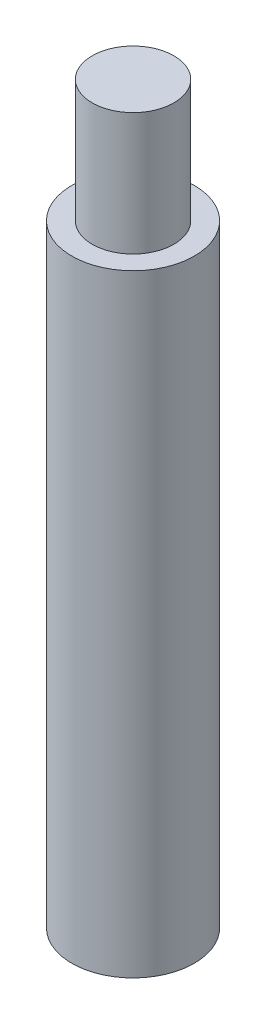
ISO-10303-21;
HEADER;
FILE_DESCRIPTION(('STEP AP214'),'2;1');
FILE_NAME('part.step','',(''),(''),'','','');
FILE_SCHEMA(('AUTOMOTIVE_DESIGN { 1 0 10303 214 1 1 1 1 }'));
ENDSEC;
DATA;
#1=APPLICATION_CONTEXT('core data for automotive mechanical design processes');
#2=APPLICATION_PROTOCOL_DEFINITION('international standard','automotive_design',2000,#1);
#3=PRODUCT_CONTEXT('',#1,'mechanical');
#4=PRODUCT('Part','Part','',(#3));
#5=PRODUCT_RELATED_PRODUCT_CATEGORY('part','',(#4));
#6=PRODUCT_DEFINITION_FORMATION('','',#4);
#7=PRODUCT_DEFINITION_CONTEXT('part definition',#1,'design');
#8=PRODUCT_DEFINITION('design','',#6,#7);
#9=PRODUCT_DEFINITION_SHAPE('','',#8);
#10=(LENGTH_UNIT() NAMED_UNIT(*) SI_UNIT(.MILLI.,.METRE.));
#11=(NAMED_UNIT(*) PLANE_ANGLE_UNIT() SI_UNIT($,.RADIAN.));
#12=(NAMED_UNIT(*) SI_UNIT($,.STERADIAN.) SOLID_ANGLE_UNIT());
#13=UNCERTAINTY_MEASURE_WITH_UNIT(LENGTH_MEASURE(1.E-05),#10,'distance_accuracy_value','');
#14=(GEOMETRIC_REPRESENTATION_CONTEXT(3) GLOBAL_UNCERTAINTY_ASSIGNED_CONTEXT((#13)) GLOBAL_UNIT_ASSIGNED_CONTEXT((#10,
#11,#12)) REPRESENTATION_CONTEXT('',''));
#15=CARTESIAN_POINT('',(0.,0.,0.));
#16=DIRECTION('',(0.,0.,1.));
#17=DIRECTION('',(1.,0.,0.));
#18=AXIS2_PLACEMENT_3D('',#15,#16,#17);
#19=CARTESIAN_POINT('',(0.,0.,0.));
#20=DIRECTION('',(0.,-1.,0.));
#21=DIRECTION('',(0.,0.,-1.));
#22=AXIS2_PLACEMENT_3D('',#19,#20,#21);
#23=PLANE('',#22);
#24=CARTESIAN_POINT('',(0.,0.,0.));
#25=DIRECTION('',(0.,-1.,0.));
#26=DIRECTION('',(0.,0.,-1.));
#27=AXIS2_PLACEMENT_3D('',#24,#25,#26);
#28=CIRCLE('',#27,1.5);
#29=CARTESIAN_POINT('',(0.,0.,-1.5));
#30=VERTEX_POINT('',#29);
#31=EDGE_CURVE('E10',#30,#30,#28,.T.);
#32=ORIENTED_EDGE('',*,*,#31,.T.);
#33=EDGE_LOOP('',(#32));
#34=FACE_BOUND('',#33,.T.);
#35=ADVANCED_FACE('F31',(#34),#23,.T.);
#36=CARTESIAN_POINT('',(0.,-2.22085852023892,0.));
#37=DIRECTION('',(0.,-1.,0.));
#38=DIRECTION('',(0.,0.,-1.));
#39=AXIS2_PLACEMENT_3D('',#36,#37,#38);
#40=CYLINDRICAL_SURFACE('',#39,1.5);
#41=CARTESIAN_POINT('',(0.,15.,0.));
#42=DIRECTION('',(0.,-1.,0.));
#43=DIRECTION('',(0.,0.,-1.));
#44=AXIS2_PLACEMENT_3D('',#41,#42,#43);
#45=CIRCLE('',#44,1.5);
#46=CARTESIAN_POINT('',(0.,15.,-1.5));
#47=VERTEX_POINT('',#46);
#48=EDGE_CURVE('E37',#47,#47,#45,.T.);
#49=ORIENTED_EDGE('',*,*,#48,.T.);
#50=EDGE_LOOP('',(#49));
#51=FACE_BOUND('',#50,.T.);
#52=ORIENTED_EDGE('',*,*,#31,.F.);
#53=EDGE_LOOP('',(#52));
#54=FACE_BOUND('',#53,.T.);
#55=ADVANCED_FACE('F63',(#51,#54),#40,.T.);
#56=CARTESIAN_POINT('',(1.5,15.,0.));
#57=DIRECTION('',(0.,1.,0.));
#58=DIRECTION('',(0.,0.,1.));
#59=AXIS2_PLACEMENT_3D('',#56,#57,#58);
#60=PLANE('',#59);
#61=CARTESIAN_POINT('',(0.,15.,0.));
#62=DIRECTION('',(0.,-1.,0.));
#63=DIRECTION('',(0.,0.,-1.));
#64=AXIS2_PLACEMENT_3D('',#61,#62,#63);
#65=CIRCLE('',#64,1.);
#66=CARTESIAN_POINT('',(0.,15.,-1.));
#67=VERTEX_POINT('',#66);
#68=EDGE_CURVE('E41',#67,#67,#65,.T.);
#69=ORIENTED_EDGE('',*,*,#68,.T.);
#70=EDGE_LOOP('',(#69));
#71=FACE_BOUND('',#70,.T.);
#72=ORIENTED_EDGE('',*,*,#48,.F.);
#73=EDGE_LOOP('',(#72));
#74=FACE_BOUND('',#73,.T.);
#75=ADVANCED_FACE('F60',(#71,#74),#60,.T.);
#76=CARTESIAN_POINT('',(0.,-2.22085852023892,0.));
#77=DIRECTION('',(0.,-1.,0.));
#78=DIRECTION('',(0.,0.,-1.));
#79=AXIS2_PLACEMENT_3D('',#76,#77,#78);
#80=CYLINDRICAL_SURFACE('',#79,1.);
#81=CARTESIAN_POINT('',(0.,18.,0.));
#82=DIRECTION('',(0.,-1.,0.));
#83=DIRECTION('',(0.,0.,-1.));
#84=AXIS2_PLACEMENT_3D('',#81,#82,#83);
#85=CIRCLE('',#84,1.);
#86=CARTESIAN_POINT('',(0.,18.,-1.));
#87=VERTEX_POINT('',#86);
#88=EDGE_CURVE('E45',#87,#87,#85,.T.);
#89=ORIENTED_EDGE('',*,*,#88,.T.);
#90=EDGE_LOOP('',(#89));
#91=FACE_BOUND('',#90,.T.);
#92=ORIENTED_EDGE('',*,*,#68,.F.);
#93=EDGE_LOOP('',(#92));
#94=FACE_BOUND('',#93,.T.);
#95=ADVANCED_FACE('F51',(#91,#94),#80,.T.);
#96=CARTESIAN_POINT('',(1.,18.,0.));
#97=DIRECTION('',(0.,1.,0.));
#98=DIRECTION('',(0.,0.,1.));
#99=AXIS2_PLACEMENT_3D('',#96,#97,#98);
#100=PLANE('',#99);
#101=ORIENTED_EDGE('',*,*,#88,.F.);
#102=EDGE_LOOP('',(#101));
#103=FACE_BOUND('',#102,.T.);
#104=ADVANCED_FACE('F54',(#103),#100,.T.);
#105=CLOSED_SHELL('',(#35,#55,#75,#95,#104));
#106=MANIFOLD_SOLID_BREP('B2',#105);
#107=ADVANCED_BREP_SHAPE_REPRESENTATION('',(#18,#106),#14);
#108=SHAPE_DEFINITION_REPRESENTATION(#9,#107);
ENDSEC;
END-ISO-10303-21;
